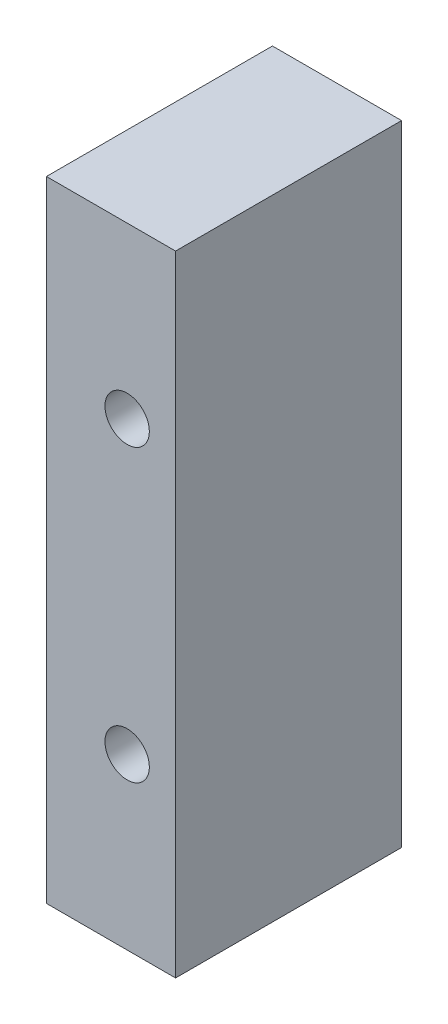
ISO-10303-21;
HEADER;
FILE_DESCRIPTION(('STEP AP214'),'2;1');
FILE_NAME('part.step','',(''),(''),'','','');
FILE_SCHEMA(('AUTOMOTIVE_DESIGN { 1 0 10303 214 1 1 1 1 }'));
ENDSEC;
DATA;
#1=APPLICATION_CONTEXT('core data for automotive mechanical design processes');
#2=APPLICATION_PROTOCOL_DEFINITION('international standard','automotive_design',2000,#1);
#3=PRODUCT_CONTEXT('',#1,'mechanical');
#4=PRODUCT('Part','Part','',(#3));
#5=PRODUCT_RELATED_PRODUCT_CATEGORY('part','',(#4));
#6=PRODUCT_DEFINITION_FORMATION('','',#4);
#7=PRODUCT_DEFINITION_CONTEXT('part definition',#1,'design');
#8=PRODUCT_DEFINITION('design','',#6,#7);
#9=PRODUCT_DEFINITION_SHAPE('','',#8);
#10=(LENGTH_UNIT() NAMED_UNIT(*) SI_UNIT(.MILLI.,.METRE.));
#11=(NAMED_UNIT(*) PLANE_ANGLE_UNIT() SI_UNIT($,.RADIAN.));
#12=(NAMED_UNIT(*) SI_UNIT($,.STERADIAN.) SOLID_ANGLE_UNIT());
#13=UNCERTAINTY_MEASURE_WITH_UNIT(LENGTH_MEASURE(1.E-05),#10,'distance_accuracy_value','');
#14=(GEOMETRIC_REPRESENTATION_CONTEXT(3) GLOBAL_UNCERTAINTY_ASSIGNED_CONTEXT((#13)) GLOBAL_UNIT_ASSIGNED_CONTEXT((#10,
#11,#12)) REPRESENTATION_CONTEXT('',''));
#15=CARTESIAN_POINT('',(0.,0.,0.));
#16=DIRECTION('',(0.,0.,1.));
#17=DIRECTION('',(1.,0.,0.));
#18=AXIS2_PLACEMENT_3D('',#15,#16,#17);
#19=CARTESIAN_POINT('',(-8.,39.,28.));
#20=DIRECTION('',(1.,0.,0.));
#21=DIRECTION('',(0.,1.,0.));
#22=AXIS2_PLACEMENT_3D('',#19,#20,#21);
#23=PLANE('',#22);
#24=DIRECTION('',(0.,-1.,0.));
#25=VECTOR('',#24,1.);
#26=CARTESIAN_POINT('',(-8.,39.,0.));
#27=LINE('',#26,#25);
#28=CARTESIAN_POINT('',(-8.,39.,0.));
#29=VERTEX_POINT('',#28);
#30=CARTESIAN_POINT('',(-7.99999999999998,-39.,0.));
#31=VERTEX_POINT('',#30);
#32=EDGE_CURVE('E74',#29,#31,#27,.T.);
#33=ORIENTED_EDGE('',*,*,#32,.T.);
#34=DIRECTION('',(0.,0.,-1.));
#35=VECTOR('',#34,1.);
#36=CARTESIAN_POINT('',(-7.99999999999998,-39.,28.));
#37=LINE('',#36,#35);
#38=CARTESIAN_POINT('',(-7.99999999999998,-39.,28.));
#39=VERTEX_POINT('',#38);
#40=EDGE_CURVE('E11',#39,#31,#37,.T.);
#41=ORIENTED_EDGE('',*,*,#40,.F.);
#42=DIRECTION('',(0.,-1.,0.));
#43=VECTOR('',#42,1.);
#44=CARTESIAN_POINT('',(-8.,39.,28.));
#45=LINE('',#44,#43);
#46=CARTESIAN_POINT('',(-8.,39.,28.));
#47=VERTEX_POINT('',#46);
#48=EDGE_CURVE('E97',#47,#39,#45,.T.);
#49=ORIENTED_EDGE('',*,*,#48,.F.);
#50=DIRECTION('',(0.,0.,-1.));
#51=VECTOR('',#50,1.);
#52=CARTESIAN_POINT('',(-8.,39.,28.));
#53=LINE('',#52,#51);
#54=EDGE_CURVE('E86',#47,#29,#53,.T.);
#55=ORIENTED_EDGE('',*,*,#54,.T.);
#56=EDGE_LOOP('',(#33,#41,#49,#55));
#57=FACE_BOUND('',#56,.T.);
#58=ADVANCED_FACE('F30',(#57),#23,.F.);
#59=CARTESIAN_POINT('',(-7.99999999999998,-39.,28.));
#60=DIRECTION('',(0.,1.,0.));
#61=DIRECTION('',(0.,0.,1.));
#62=AXIS2_PLACEMENT_3D('',#59,#60,#61);
#63=PLANE('',#62);
#64=DIRECTION('',(1.,0.,0.));
#65=VECTOR('',#64,1.);
#66=CARTESIAN_POINT('',(-7.99999999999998,-39.,0.));
#67=LINE('',#66,#65);
#68=CARTESIAN_POINT('',(7.99999999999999,-39.,0.));
#69=VERTEX_POINT('',#68);
#70=EDGE_CURVE('E70',#31,#69,#67,.T.);
#71=ORIENTED_EDGE('',*,*,#70,.T.);
#72=DIRECTION('',(0.,0.,-1.));
#73=VECTOR('',#72,1.);
#74=CARTESIAN_POINT('',(7.99999999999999,-39.,28.));
#75=LINE('',#74,#73);
#76=CARTESIAN_POINT('',(7.99999999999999,-39.,28.));
#77=VERTEX_POINT('',#76);
#78=EDGE_CURVE('E37',#77,#69,#75,.T.);
#79=ORIENTED_EDGE('',*,*,#78,.F.);
#80=DIRECTION('',(1.,0.,0.));
#81=VECTOR('',#80,1.);
#82=CARTESIAN_POINT('',(-7.99999999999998,-39.,28.));
#83=LINE('',#82,#81);
#84=EDGE_CURVE('E82',#39,#77,#83,.T.);
#85=ORIENTED_EDGE('',*,*,#84,.F.);
#86=ORIENTED_EDGE('',*,*,#40,.T.);
#87=EDGE_LOOP('',(#71,#79,#85,#86));
#88=FACE_BOUND('',#87,.T.);
#89=ADVANCED_FACE('F81',(#88),#63,.F.);
#90=CARTESIAN_POINT('',(8.,39.,28.));
#91=DIRECTION('',(-1.,0.,0.));
#92=DIRECTION('',(0.,-1.,0.));
#93=AXIS2_PLACEMENT_3D('',#90,#91,#92);
#94=PLANE('',#93);
#95=DIRECTION('',(0.,1.,0.));
#96=VECTOR('',#95,1.);
#97=CARTESIAN_POINT('',(8.,39.,0.));
#98=LINE('',#97,#96);
#99=CARTESIAN_POINT('',(8.,39.,0.));
#100=VERTEX_POINT('',#99);
#101=EDGE_CURVE('E75',#69,#100,#98,.T.);
#102=ORIENTED_EDGE('',*,*,#101,.T.);
#103=DIRECTION('',(0.,0.,-1.));
#104=VECTOR('',#103,1.);
#105=CARTESIAN_POINT('',(8.,39.,28.));
#106=LINE('',#105,#104);
#107=CARTESIAN_POINT('',(8.,39.,28.));
#108=VERTEX_POINT('',#107);
#109=EDGE_CURVE('E103',#108,#100,#106,.T.);
#110=ORIENTED_EDGE('',*,*,#109,.F.);
#111=DIRECTION('',(0.,1.,0.));
#112=VECTOR('',#111,1.);
#113=CARTESIAN_POINT('',(8.,39.,28.));
#114=LINE('',#113,#112);
#115=EDGE_CURVE('E49',#77,#108,#114,.T.);
#116=ORIENTED_EDGE('',*,*,#115,.F.);
#117=ORIENTED_EDGE('',*,*,#78,.T.);
#118=EDGE_LOOP('',(#102,#110,#116,#117));
#119=FACE_BOUND('',#118,.T.);
#120=ADVANCED_FACE('F106',(#119),#94,.F.);
#121=CARTESIAN_POINT('',(-8.,39.,28.));
#122=DIRECTION('',(0.,-1.,0.));
#123=DIRECTION('',(0.,0.,-1.));
#124=AXIS2_PLACEMENT_3D('',#121,#122,#123);
#125=PLANE('',#124);
#126=DIRECTION('',(-1.,0.,0.));
#127=VECTOR('',#126,1.);
#128=CARTESIAN_POINT('',(-8.,39.,0.));
#129=LINE('',#128,#127);
#130=EDGE_CURVE('E95',#100,#29,#129,.T.);
#131=ORIENTED_EDGE('',*,*,#130,.T.);
#132=ORIENTED_EDGE('',*,*,#54,.F.);
#133=DIRECTION('',(-1.,0.,0.));
#134=VECTOR('',#133,1.);
#135=CARTESIAN_POINT('',(-8.,39.,28.));
#136=LINE('',#135,#134);
#137=EDGE_CURVE('E44',#108,#47,#136,.T.);
#138=ORIENTED_EDGE('',*,*,#137,.F.);
#139=ORIENTED_EDGE('',*,*,#109,.T.);
#140=EDGE_LOOP('',(#131,#132,#138,#139));
#141=FACE_BOUND('',#140,.T.);
#142=ADVANCED_FACE('F108',(#141),#125,.F.);
#143=CARTESIAN_POINT('',(-7.99999999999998,-39.,28.));
#144=DIRECTION('',(0.,0.,1.));
#145=DIRECTION('',(1.,0.,0.));
#146=AXIS2_PLACEMENT_3D('',#143,#144,#145);
#147=PLANE('',#146);
#148=CARTESIAN_POINT('',(2.,-18.,28.));
#149=DIRECTION('',(0.,0.,1.));
#150=DIRECTION('',(1.,0.,0.));
#151=AXIS2_PLACEMENT_3D('',#148,#149,#150);
#152=CIRCLE('',#151,2.75);
#153=CARTESIAN_POINT('',(4.75,-18.,28.));
#154=VERTEX_POINT('',#153);
#155=EDGE_CURVE('E175',#154,#154,#152,.T.);
#156=ORIENTED_EDGE('',*,*,#155,.F.);
#157=EDGE_LOOP('',(#156));
#158=FACE_BOUND('',#157,.T.);
#159=CARTESIAN_POINT('',(2.,18.,28.));
#160=DIRECTION('',(0.,0.,1.));
#161=DIRECTION('',(1.,0.,0.));
#162=AXIS2_PLACEMENT_3D('',#159,#160,#161);
#163=CIRCLE('',#162,2.75);
#164=CARTESIAN_POINT('',(4.75,18.,28.));
#165=VERTEX_POINT('',#164);
#166=EDGE_CURVE('E90',#165,#165,#163,.T.);
#167=ORIENTED_EDGE('',*,*,#166,.F.);
#168=EDGE_LOOP('',(#167));
#169=FACE_BOUND('',#168,.T.);
#170=ORIENTED_EDGE('',*,*,#48,.T.);
#171=ORIENTED_EDGE('',*,*,#84,.T.);
#172=ORIENTED_EDGE('',*,*,#115,.T.);
#173=ORIENTED_EDGE('',*,*,#137,.T.);
#174=EDGE_LOOP('',(#170,#171,#172,#173));
#175=FACE_BOUND('',#174,.T.);
#176=ADVANCED_FACE('F109',(#158,#169,#175),#147,.T.);
#177=CARTESIAN_POINT('',(-7.99999999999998,-39.,0.));
#178=DIRECTION('',(0.,0.,1.));
#179=DIRECTION('',(1.,0.,0.));
#180=AXIS2_PLACEMENT_3D('',#177,#178,#179);
#181=PLANE('',#180);
#182=CARTESIAN_POINT('',(2.,-18.,0.));
#183=DIRECTION('',(0.,0.,1.));
#184=DIRECTION('',(1.,0.,0.));
#185=AXIS2_PLACEMENT_3D('',#182,#183,#184);
#186=CIRCLE('',#185,2.75);
#187=CARTESIAN_POINT('',(4.75,-18.,0.));
#188=VERTEX_POINT('',#187);
#189=EDGE_CURVE('E173',#188,#188,#186,.T.);
#190=ORIENTED_EDGE('',*,*,#189,.T.);
#191=EDGE_LOOP('',(#190));
#192=FACE_BOUND('',#191,.T.);
#193=CARTESIAN_POINT('',(2.,18.,0.));
#194=DIRECTION('',(0.,0.,1.));
#195=DIRECTION('',(1.,0.,0.));
#196=AXIS2_PLACEMENT_3D('',#193,#194,#195);
#197=CIRCLE('',#196,2.75);
#198=CARTESIAN_POINT('',(4.75,18.,0.));
#199=VERTEX_POINT('',#198);
#200=EDGE_CURVE('E87',#199,#199,#197,.T.);
#201=ORIENTED_EDGE('',*,*,#200,.T.);
#202=EDGE_LOOP('',(#201));
#203=FACE_BOUND('',#202,.T.);
#204=ORIENTED_EDGE('',*,*,#32,.F.);
#205=ORIENTED_EDGE('',*,*,#130,.F.);
#206=ORIENTED_EDGE('',*,*,#101,.F.);
#207=ORIENTED_EDGE('',*,*,#70,.F.);
#208=EDGE_LOOP('',(#204,#205,#206,#207));
#209=FACE_BOUND('',#208,.T.);
#210=ADVANCED_FACE('F71',(#192,#203,#209),#181,.F.);
#211=CARTESIAN_POINT('',(2.,18.,0.));
#212=DIRECTION('',(0.,0.,1.));
#213=DIRECTION('',(1.,0.,0.));
#214=AXIS2_PLACEMENT_3D('',#211,#212,#213);
#215=CYLINDRICAL_SURFACE('',#214,2.75);
#216=ORIENTED_EDGE('',*,*,#200,.F.);
#217=EDGE_LOOP('',(#216));
#218=FACE_BOUND('',#217,.T.);
#219=ORIENTED_EDGE('',*,*,#166,.T.);
#220=EDGE_LOOP('',(#219));
#221=FACE_BOUND('',#220,.T.);
#222=ADVANCED_FACE('F117',(#218,#221),#215,.F.);
#223=CARTESIAN_POINT('',(2.,-18.,0.));
#224=DIRECTION('',(0.,0.,1.));
#225=DIRECTION('',(1.,0.,0.));
#226=AXIS2_PLACEMENT_3D('',#223,#224,#225);
#227=CYLINDRICAL_SURFACE('',#226,2.75);
#228=ORIENTED_EDGE('',*,*,#189,.F.);
#229=EDGE_LOOP('',(#228));
#230=FACE_BOUND('',#229,.T.);
#231=ORIENTED_EDGE('',*,*,#155,.T.);
#232=EDGE_LOOP('',(#231));
#233=FACE_BOUND('',#232,.T.);
#234=ADVANCED_FACE('F156',(#230,#233),#227,.F.);
#235=CLOSED_SHELL('',(#58,#89,#120,#142,#176,#210,#222,#234));
#236=MANIFOLD_SOLID_BREP('B2',#235);
#237=ADVANCED_BREP_SHAPE_REPRESENTATION('',(#18,#236),#14);
#238=SHAPE_DEFINITION_REPRESENTATION(#9,#237);
ENDSEC;
END-ISO-10303-21;
